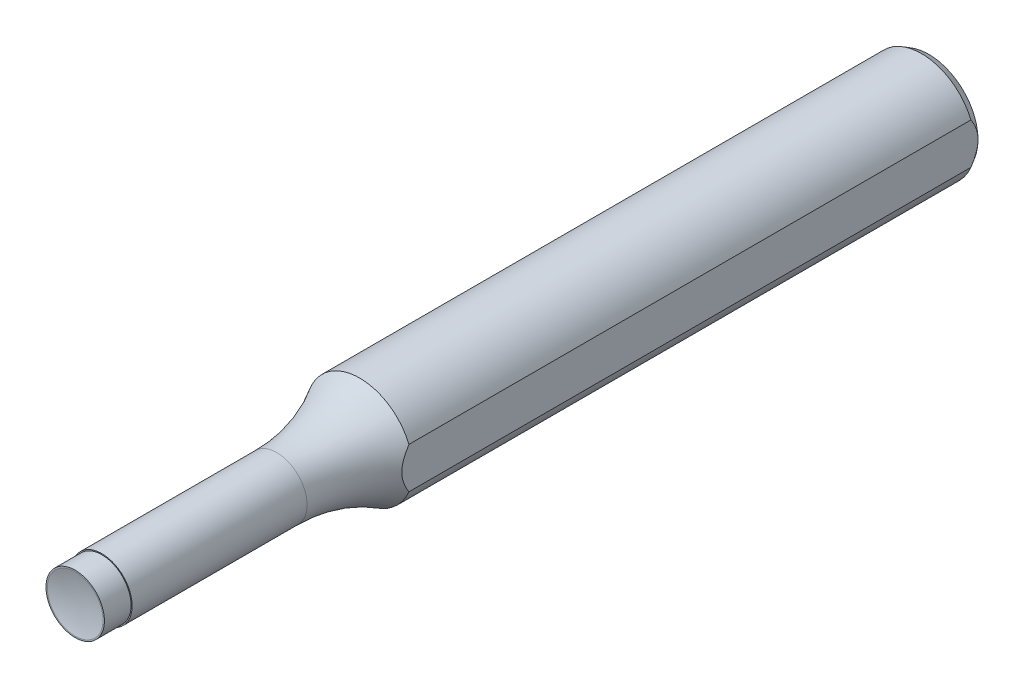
from build123d import *

# Parameters (mm, degrees)
SKETCH1_R           = 7.94
BOSS_EXTRUDE1_DEPTH = 127
SKETCH2_OUTSIDE_W   = 43.674
SKETCH2_OUTSIDE_H   = 43.674
SKETCH2_OUTSIDE_R   = 4.5
CUT_EXTRUDE1_DEPTH  = 42.333333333
SKETCH3_OUTSIDE_W   = 43.674
SKETCH3_OUTSIDE_H   = 43.674
SKETCH3_OUTSIDE_R   = 4.35
CUT_EXTRUDE2_DEPTH  = 3.97
CHAMFER1_SIZE       = 1.058666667
CHAMFER1_SIZE2      = 0.611221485
SKETCH7_W           = 6.109862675
SKETCH7_H           = 6.109862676
CUT_EXTRUDE3_DEPTH  = 128.495439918


with BuildPart() as part:
    # Sketch1 → Boss-Extrude1 (new body)
    with BuildSketch(Plane.XY):
        Circle(SKETCH1_R)
    extrude(amount=-BOSS_EXTRUDE1_DEPTH)

    # Sketch2 outside → Cut-Extrude1 (cut)
    with BuildSketch(Plane.XY):
        Rectangle(SKETCH2_OUTSIDE_W, SKETCH2_OUTSIDE_H)
        Circle(SKETCH2_OUTSIDE_R, mode=Mode.SUBTRACT)
    extrude(amount=-CUT_EXTRUDE1_DEPTH, mode=Mode.SUBTRACT)

    # Sketch3 outside → Cut-Extrude2 (cut)
    with BuildSketch(Plane.XY):
        Rectangle(SKETCH3_OUTSIDE_W, SKETCH3_OUTSIDE_H)
        Circle(SKETCH3_OUTSIDE_R, mode=Mode.SUBTRACT)
    extrude(amount=-CUT_EXTRUDE2_DEPTH, mode=Mode.SUBTRACT)

    # Sketch4 → Cut-Revolve1 (revolve, cut)
    with BuildSketch(Plane(origin=(0, 0, 0), x_dir=(0, 0, -1), z_dir=(1, 0, 0))):
        with BuildLine():
            Line((0, 0), (0, 4.15))
            ThreePointArc((0, 4.15), (0.413289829, 2.093265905), (0.551859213, 0))
            Line((0.551859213, 0), (0, 0))
        make_face()
    revolve(axis=Axis((0, 0, 0), (0, 0, -1)), mode=Mode.SUBTRACT)

    # Chamfer1
    chamfer1_edges = [part.edges().sort_by_distance(p)[0] for p in [
        (-7.94, 0, -127),
    ]]
    chamfer1_side = [part.faces().sort_by_distance(p)[0] for p in [
        (-7.94, 0, -84.666666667),
    ]]
    chamfer(chamfer1_edges, length=CHAMFER1_SIZE, length2=CHAMFER1_SIZE2, reference=chamfer1_side[0])

    # Sketch5 → Revolve1 (revolve)
    with BuildSketch(Plane(origin=(0, 0, 0), x_dir=(0, 0, -1), z_dir=(1, 0, 0)), mode=Mode.PRIVATE) as revolve1_sk:
        with BuildLine():
            Line((42.333333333, 0), (30.002558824, 0))
            Line((30.002558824, 0), (30.002558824, 4.5))
            ThreePointArc((30.002558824, 4.5), (36.403371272, 5.376111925), (42.333333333, 7.94))
            Line((42.333333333, 7.94), (42.333333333, 0))
        make_face()
    revolve(revolve1_sk.sketch.rotate(Axis((0, 0, -42.333333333), (0, 0, 1)), 270), axis=Axis((0, 0, -42.333333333), (0, 0, 1)))

    # Sketch7 → Cut-Extrude3 (cut, through all)
    with BuildSketch(Plane(origin=(0, 0, -127), x_dir=(-1, 0, 0), z_dir=(0, 0, -1))):
        with Locations((-10.383709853, 0)):
            Rectangle(SKETCH7_W, SKETCH7_H)
    extrude(amount=-CUT_EXTRUDE3_DEPTH, mode=Mode.SUBTRACT)


solid = part.part
